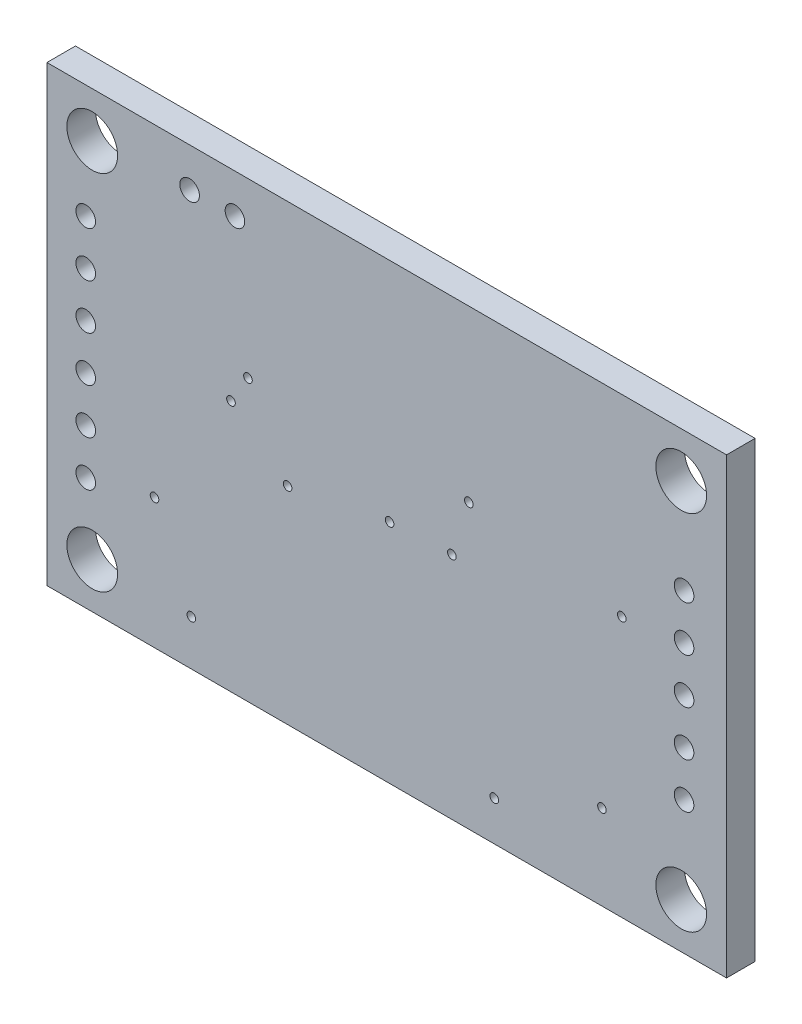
ISO-10303-21;
HEADER;
FILE_DESCRIPTION(('STEP AP214'),'2;1');
FILE_NAME('part.step','',(''),(''),'','','');
FILE_SCHEMA(('AUTOMOTIVE_DESIGN { 1 0 10303 214 1 1 1 1 }'));
ENDSEC;
DATA;
#1=APPLICATION_CONTEXT('core data for automotive mechanical design processes');
#2=APPLICATION_PROTOCOL_DEFINITION('international standard','automotive_design',2000,#1);
#3=PRODUCT_CONTEXT('',#1,'mechanical');
#4=PRODUCT('Part','Part','',(#3));
#5=PRODUCT_RELATED_PRODUCT_CATEGORY('part','',(#4));
#6=PRODUCT_DEFINITION_FORMATION('','',#4);
#7=PRODUCT_DEFINITION_CONTEXT('part definition',#1,'design');
#8=PRODUCT_DEFINITION('design','',#6,#7);
#9=PRODUCT_DEFINITION_SHAPE('','',#8);
#10=(LENGTH_UNIT() NAMED_UNIT(*) SI_UNIT(.MILLI.,.METRE.));
#11=(NAMED_UNIT(*) PLANE_ANGLE_UNIT() SI_UNIT($,.RADIAN.));
#12=(NAMED_UNIT(*) SI_UNIT($,.STERADIAN.) SOLID_ANGLE_UNIT());
#13=UNCERTAINTY_MEASURE_WITH_UNIT(LENGTH_MEASURE(1.E-05),#10,'distance_accuracy_value','');
#14=(GEOMETRIC_REPRESENTATION_CONTEXT(3) GLOBAL_UNCERTAINTY_ASSIGNED_CONTEXT((#13)) GLOBAL_UNIT_ASSIGNED_CONTEXT((#10,
#11,#12)) REPRESENTATION_CONTEXT('',''));
#15=CARTESIAN_POINT('',(0.,0.,0.));
#16=DIRECTION('',(0.,0.,1.));
#17=DIRECTION('',(1.,0.,0.));
#18=AXIS2_PLACEMENT_3D('',#15,#16,#17);
#19=CARTESIAN_POINT('',(-19.05,12.7,0.));
#20=DIRECTION('',(0.,0.,-1.));
#21=DIRECTION('',(-1.,0.,0.));
#22=AXIS2_PLACEMENT_3D('',#19,#20,#21);
#23=PLANE('',#22);
#24=CARTESIAN_POINT('',(-13.0175,-5.3975,0.));
#25=DIRECTION('',(0.,0.,1.));
#26=DIRECTION('',(1.,0.,0.));
#27=AXIS2_PLACEMENT_3D('',#24,#25,#26);
#28=CIRCLE('',#27,0.2413);
#29=CARTESIAN_POINT('',(-12.7762,-5.3975,0.));
#30=VERTEX_POINT('',#29);
#31=EDGE_CURVE('E162',#30,#30,#28,.F.);
#32=ORIENTED_EDGE('',*,*,#31,.T.);
#33=EDGE_LOOP('',(#32));
#34=FACE_BOUND('',#33,.T.);
#35=CARTESIAN_POINT('',(-5.556233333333,-1.113966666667,0.));
#36=DIRECTION('',(0.,0.,1.));
#37=DIRECTION('',(1.,0.,0.));
#38=AXIS2_PLACEMENT_3D('',#35,#36,#37);
#39=CIRCLE('',#38,0.2413);
#40=CARTESIAN_POINT('',(-5.314933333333,-1.113966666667,0.));
#41=VERTEX_POINT('',#40);
#42=EDGE_CURVE('E166',#41,#41,#39,.F.);
#43=ORIENTED_EDGE('',*,*,#42,.T.);
#44=EDGE_LOOP('',(#43));
#45=FACE_BOUND('',#44,.T.);
#46=CARTESIAN_POINT('',(0.158766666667,0.,0.));
#47=DIRECTION('',(0.,0.,1.));
#48=DIRECTION('',(1.,0.,0.));
#49=AXIS2_PLACEMENT_3D('',#46,#47,#48);
#50=CIRCLE('',#49,0.2413);
#51=CARTESIAN_POINT('',(0.400066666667,0.,0.));
#52=VERTEX_POINT('',#51);
#53=EDGE_CURVE('E169',#52,#52,#50,.F.);
#54=ORIENTED_EDGE('',*,*,#53,.T.);
#55=EDGE_LOOP('',(#54));
#56=FACE_BOUND('',#55,.T.);
#57=CARTESIAN_POINT('',(-8.731233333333,1.428733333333,0.));
#58=DIRECTION('',(0.,0.,1.));
#59=DIRECTION('',(1.,0.,0.));
#60=AXIS2_PLACEMENT_3D('',#57,#58,#59);
#61=CIRCLE('',#60,0.2413);
#62=CARTESIAN_POINT('',(-8.489933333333,1.428733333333,0.));
#63=VERTEX_POINT('',#62);
#64=EDGE_CURVE('E172',#63,#63,#61,.F.);
#65=ORIENTED_EDGE('',*,*,#64,.T.);
#66=EDGE_LOOP('',(#65));
#67=FACE_BOUND('',#66,.T.);
#68=CARTESIAN_POINT('',(6.0325,-10.4775,0.));
#69=DIRECTION('',(0.,0.,1.));
#70=DIRECTION('',(1.,0.,0.));
#71=AXIS2_PLACEMENT_3D('',#68,#69,#70);
#72=CIRCLE('',#71,0.2413);
#73=CARTESIAN_POINT('',(6.2738,-10.4775,0.));
#74=VERTEX_POINT('',#73);
#75=EDGE_CURVE('E175',#74,#74,#72,.F.);
#76=ORIENTED_EDGE('',*,*,#75,.T.);
#77=EDGE_LOOP('',(#76));
#78=FACE_BOUND('',#77,.T.);
#79=CARTESIAN_POINT('',(-10.95373333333,-10.16,0.));
#80=DIRECTION('',(0.,0.,1.));
#81=DIRECTION('',(1.,0.,0.));
#82=AXIS2_PLACEMENT_3D('',#79,#80,#81);
#83=CIRCLE('',#82,0.2413);
#84=CARTESIAN_POINT('',(-10.71243333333,-10.16,0.));
#85=VERTEX_POINT('',#84);
#86=EDGE_CURVE('E178',#85,#85,#83,.F.);
#87=ORIENTED_EDGE('',*,*,#86,.T.);
#88=EDGE_LOOP('',(#87));
#89=FACE_BOUND('',#88,.T.);
#90=CARTESIAN_POINT('',(12.065,-7.9375,0.));
#91=DIRECTION('',(0.,0.,1.));
#92=DIRECTION('',(1.,0.,0.));
#93=AXIS2_PLACEMENT_3D('',#90,#91,#92);
#94=CIRCLE('',#93,0.2413);
#95=CARTESIAN_POINT('',(12.3063,-7.9375,0.));
#96=VERTEX_POINT('',#95);
#97=EDGE_CURVE('E181',#96,#96,#94,.F.);
#98=ORIENTED_EDGE('',*,*,#97,.T.);
#99=EDGE_LOOP('',(#98));
#100=FACE_BOUND('',#99,.T.);
#101=CARTESIAN_POINT('',(3.651266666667,0.158733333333,0.));
#102=DIRECTION('',(0.,0.,1.));
#103=DIRECTION('',(1.,0.,0.));
#104=AXIS2_PLACEMENT_3D('',#101,#102,#103);
#105=CIRCLE('',#104,0.2413);
#106=CARTESIAN_POINT('',(3.892566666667,0.158733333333,0.));
#107=VERTEX_POINT('',#106);
#108=EDGE_CURVE('E184',#107,#107,#105,.F.);
#109=ORIENTED_EDGE('',*,*,#108,.T.);
#110=EDGE_LOOP('',(#109));
#111=FACE_BOUND('',#110,.T.);
#112=CARTESIAN_POINT('',(13.176266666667,1.905,0.));
#113=DIRECTION('',(0.,0.,1.));
#114=DIRECTION('',(1.,0.,0.));
#115=AXIS2_PLACEMENT_3D('',#112,#113,#114);
#116=CIRCLE('',#115,0.2413);
#117=CARTESIAN_POINT('',(13.417566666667,1.905,0.));
#118=VERTEX_POINT('',#117);
#119=EDGE_CURVE('E187',#118,#118,#116,.F.);
#120=ORIENTED_EDGE('',*,*,#119,.T.);
#121=EDGE_LOOP('',(#120));
#122=FACE_BOUND('',#121,.T.);
#123=CARTESIAN_POINT('',(-7.778733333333,3.016266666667,0.));
#124=DIRECTION('',(0.,0.,1.));
#125=DIRECTION('',(1.,0.,0.));
#126=AXIS2_PLACEMENT_3D('',#123,#124,#125);
#127=CIRCLE('',#126,0.2413);
#128=CARTESIAN_POINT('',(-7.537433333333,3.016266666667,0.));
#129=VERTEX_POINT('',#128);
#130=EDGE_CURVE('E190',#129,#129,#127,.F.);
#131=ORIENTED_EDGE('',*,*,#130,.T.);
#132=EDGE_LOOP('',(#131));
#133=FACE_BOUND('',#132,.T.);
#134=CARTESIAN_POINT('',(4.603766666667,3.175,0.));
#135=DIRECTION('',(0.,0.,1.));
#136=DIRECTION('',(1.,0.,0.));
#137=AXIS2_PLACEMENT_3D('',#134,#135,#136);
#138=CIRCLE('',#137,0.2413);
#139=CARTESIAN_POINT('',(4.845066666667,3.175,0.));
#140=VERTEX_POINT('',#139);
#141=EDGE_CURVE('E193',#140,#140,#138,.F.);
#142=ORIENTED_EDGE('',*,*,#141,.T.);
#143=EDGE_LOOP('',(#142));
#144=FACE_BOUND('',#143,.T.);
#145=CARTESIAN_POINT('',(16.668766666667,4.921266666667,0.));
#146=DIRECTION('',(0.,0.,1.));
#147=DIRECTION('',(1.,0.,0.));
#148=AXIS2_PLACEMENT_3D('',#145,#146,#147);
#149=CIRCLE('',#148,0.55);
#150=CARTESIAN_POINT('',(17.218766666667,4.921266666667,0.));
#151=VERTEX_POINT('',#150);
#152=EDGE_CURVE('E196',#151,#151,#149,.F.);
#153=ORIENTED_EDGE('',*,*,#152,.T.);
#154=EDGE_LOOP('',(#153));
#155=FACE_BOUND('',#154,.T.);
#156=CARTESIAN_POINT('',(16.668766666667,2.381266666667,0.));
#157=DIRECTION('',(0.,0.,1.));
#158=DIRECTION('',(1.,0.,0.));
#159=AXIS2_PLACEMENT_3D('',#156,#157,#158);
#160=CIRCLE('',#159,0.55);
#161=CARTESIAN_POINT('',(17.218766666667,2.381266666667,0.));
#162=VERTEX_POINT('',#161);
#163=EDGE_CURVE('E199',#162,#162,#160,.F.);
#164=ORIENTED_EDGE('',*,*,#163,.T.);
#165=EDGE_LOOP('',(#164));
#166=FACE_BOUND('',#165,.T.);
#167=CARTESIAN_POINT('',(16.668766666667,-0.158733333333,0.));
#168=DIRECTION('',(0.,0.,1.));
#169=DIRECTION('',(1.,0.,0.));
#170=AXIS2_PLACEMENT_3D('',#167,#168,#169);
#171=CIRCLE('',#170,0.55);
#172=CARTESIAN_POINT('',(17.218766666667,-0.158733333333,0.));
#173=VERTEX_POINT('',#172);
#174=EDGE_CURVE('E202',#173,#173,#171,.F.);
#175=ORIENTED_EDGE('',*,*,#174,.T.);
#176=EDGE_LOOP('',(#175));
#177=FACE_BOUND('',#176,.T.);
#178=CARTESIAN_POINT('',(16.668766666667,-2.698733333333,0.));
#179=DIRECTION('',(0.,0.,1.));
#180=DIRECTION('',(1.,0.,0.));
#181=AXIS2_PLACEMENT_3D('',#178,#179,#180);
#182=CIRCLE('',#181,0.55);
#183=CARTESIAN_POINT('',(17.218766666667,-2.698733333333,0.));
#184=VERTEX_POINT('',#183);
#185=EDGE_CURVE('E205',#184,#184,#182,.F.);
#186=ORIENTED_EDGE('',*,*,#185,.T.);
#187=EDGE_LOOP('',(#186));
#188=FACE_BOUND('',#187,.T.);
#189=CARTESIAN_POINT('',(16.668766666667,-5.238733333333,0.));
#190=DIRECTION('',(0.,0.,1.));
#191=DIRECTION('',(1.,0.,0.));
#192=AXIS2_PLACEMENT_3D('',#189,#190,#191);
#193=CIRCLE('',#192,0.55);
#194=CARTESIAN_POINT('',(17.218766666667,-5.238733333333,0.));
#195=VERTEX_POINT('',#194);
#196=EDGE_CURVE('E208',#195,#195,#193,.F.);
#197=ORIENTED_EDGE('',*,*,#196,.T.);
#198=EDGE_LOOP('',(#197));
#199=FACE_BOUND('',#198,.T.);
#200=CARTESIAN_POINT('',(-16.8752,6.3293,0.));
#201=DIRECTION('',(0.,0.,1.));
#202=DIRECTION('',(1.,0.,0.));
#203=AXIS2_PLACEMENT_3D('',#200,#201,#202);
#204=CIRCLE('',#203,0.55);
#205=CARTESIAN_POINT('',(-16.3252,6.3293,0.));
#206=VERTEX_POINT('',#205);
#207=EDGE_CURVE('E211',#206,#206,#204,.F.);
#208=ORIENTED_EDGE('',*,*,#207,.T.);
#209=EDGE_LOOP('',(#208));
#210=FACE_BOUND('',#209,.T.);
#211=CARTESIAN_POINT('',(-16.8752,3.7893,0.));
#212=DIRECTION('',(0.,0.,1.));
#213=DIRECTION('',(1.,0.,0.));
#214=AXIS2_PLACEMENT_3D('',#211,#212,#213);
#215=CIRCLE('',#214,0.55);
#216=CARTESIAN_POINT('',(-16.3252,3.7893,0.));
#217=VERTEX_POINT('',#216);
#218=EDGE_CURVE('E214',#217,#217,#215,.F.);
#219=ORIENTED_EDGE('',*,*,#218,.T.);
#220=EDGE_LOOP('',(#219));
#221=FACE_BOUND('',#220,.T.);
#222=CARTESIAN_POINT('',(-16.8752,1.2493,0.));
#223=DIRECTION('',(0.,0.,1.));
#224=DIRECTION('',(1.,0.,0.));
#225=AXIS2_PLACEMENT_3D('',#222,#223,#224);
#226=CIRCLE('',#225,0.55);
#227=CARTESIAN_POINT('',(-16.3252,1.2493,0.));
#228=VERTEX_POINT('',#227);
#229=EDGE_CURVE('E217',#228,#228,#226,.F.);
#230=ORIENTED_EDGE('',*,*,#229,.T.);
#231=EDGE_LOOP('',(#230));
#232=FACE_BOUND('',#231,.T.);
#233=CARTESIAN_POINT('',(-16.8752,-1.2907,0.));
#234=DIRECTION('',(0.,0.,1.));
#235=DIRECTION('',(1.,0.,0.));
#236=AXIS2_PLACEMENT_3D('',#233,#234,#235);
#237=CIRCLE('',#236,0.55);
#238=CARTESIAN_POINT('',(-16.3252,-1.2907,0.));
#239=VERTEX_POINT('',#238);
#240=EDGE_CURVE('E220',#239,#239,#237,.F.);
#241=ORIENTED_EDGE('',*,*,#240,.T.);
#242=EDGE_LOOP('',(#241));
#243=FACE_BOUND('',#242,.T.);
#244=CARTESIAN_POINT('',(-16.8752,-3.8307,0.));
#245=DIRECTION('',(0.,0.,1.));
#246=DIRECTION('',(1.,0.,0.));
#247=AXIS2_PLACEMENT_3D('',#244,#245,#246);
#248=CIRCLE('',#247,0.55);
#249=CARTESIAN_POINT('',(-16.3252,-3.8307,0.));
#250=VERTEX_POINT('',#249);
#251=EDGE_CURVE('E223',#250,#250,#248,.F.);
#252=ORIENTED_EDGE('',*,*,#251,.T.);
#253=EDGE_LOOP('',(#252));
#254=FACE_BOUND('',#253,.T.);
#255=CARTESIAN_POINT('',(-16.8752,-6.3707,0.));
#256=DIRECTION('',(0.,0.,1.));
#257=DIRECTION('',(1.,0.,0.));
#258=AXIS2_PLACEMENT_3D('',#255,#256,#257);
#259=CIRCLE('',#258,0.55);
#260=CARTESIAN_POINT('',(-16.3252,-6.3707,0.));
#261=VERTEX_POINT('',#260);
#262=EDGE_CURVE('E226',#261,#261,#259,.F.);
#263=ORIENTED_EDGE('',*,*,#262,.T.);
#264=EDGE_LOOP('',(#263));
#265=FACE_BOUND('',#264,.T.);
#266=CARTESIAN_POINT('',(-8.509966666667,10.510433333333,0.));
#267=DIRECTION('',(0.,0.,1.));
#268=DIRECTION('',(1.,0.,0.));
#269=AXIS2_PLACEMENT_3D('',#266,#267,#268);
#270=CIRCLE('',#269,0.55);
#271=CARTESIAN_POINT('',(-7.959966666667,10.510433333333,0.));
#272=VERTEX_POINT('',#271);
#273=EDGE_CURVE('E229',#272,#272,#270,.F.);
#274=ORIENTED_EDGE('',*,*,#273,.T.);
#275=EDGE_LOOP('',(#274));
#276=FACE_BOUND('',#275,.T.);
#277=CARTESIAN_POINT('',(-11.04996666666,10.510433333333,0.));
#278=DIRECTION('',(0.,0.,1.));
#279=DIRECTION('',(1.,0.,0.));
#280=AXIS2_PLACEMENT_3D('',#277,#278,#279);
#281=CIRCLE('',#280,0.55);
#282=CARTESIAN_POINT('',(-10.49996666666,10.510433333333,0.));
#283=VERTEX_POINT('',#282);
#284=EDGE_CURVE('E232',#283,#283,#281,.F.);
#285=ORIENTED_EDGE('',*,*,#284,.T.);
#286=EDGE_LOOP('',(#285));
#287=FACE_BOUND('',#286,.T.);
#288=CARTESIAN_POINT('',(16.51,-10.16,0.));
#289=DIRECTION('',(0.,0.,1.));
#290=DIRECTION('',(1.,0.,0.));
#291=AXIS2_PLACEMENT_3D('',#288,#289,#290);
#292=CIRCLE('',#291,1.4224);
#293=CARTESIAN_POINT('',(17.9324,-10.16,0.));
#294=VERTEX_POINT('',#293);
#295=EDGE_CURVE('E235',#294,#294,#292,.F.);
#296=ORIENTED_EDGE('',*,*,#295,.T.);
#297=EDGE_LOOP('',(#296));
#298=FACE_BOUND('',#297,.T.);
#299=CARTESIAN_POINT('',(-16.51,-10.16,0.));
#300=DIRECTION('',(0.,0.,1.));
#301=DIRECTION('',(1.,0.,0.));
#302=AXIS2_PLACEMENT_3D('',#299,#300,#301);
#303=CIRCLE('',#302,1.4224);
#304=CARTESIAN_POINT('',(-15.0876,-10.16,0.));
#305=VERTEX_POINT('',#304);
#306=EDGE_CURVE('E238',#305,#305,#303,.F.);
#307=ORIENTED_EDGE('',*,*,#306,.T.);
#308=EDGE_LOOP('',(#307));
#309=FACE_BOUND('',#308,.T.);
#310=CARTESIAN_POINT('',(16.51,10.16,0.));
#311=DIRECTION('',(0.,0.,1.));
#312=DIRECTION('',(1.,0.,0.));
#313=AXIS2_PLACEMENT_3D('',#310,#311,#312);
#314=CIRCLE('',#313,1.4224);
#315=CARTESIAN_POINT('',(17.9324,10.16,0.));
#316=VERTEX_POINT('',#315);
#317=EDGE_CURVE('E240',#316,#316,#314,.F.);
#318=ORIENTED_EDGE('',*,*,#317,.T.);
#319=EDGE_LOOP('',(#318));
#320=FACE_BOUND('',#319,.T.);
#321=CARTESIAN_POINT('',(-16.51,10.16,0.));
#322=DIRECTION('',(0.,0.,1.));
#323=DIRECTION('',(1.,0.,0.));
#324=AXIS2_PLACEMENT_3D('',#321,#322,#323);
#325=CIRCLE('',#324,1.4224);
#326=CARTESIAN_POINT('',(-15.0876,10.16,0.));
#327=VERTEX_POINT('',#326);
#328=EDGE_CURVE('E20',#327,#327,#325,.F.);
#329=ORIENTED_EDGE('',*,*,#328,.T.);
#330=EDGE_LOOP('',(#329));
#331=FACE_BOUND('',#330,.T.);
#332=DIRECTION('',(1.,0.,0.));
#333=VECTOR('',#332,1.);
#334=CARTESIAN_POINT('',(-19.05,-12.7,0.));
#335=LINE('',#334,#333);
#336=CARTESIAN_POINT('',(19.05,-12.7,0.));
#337=VERTEX_POINT('',#336);
#338=CARTESIAN_POINT('',(-19.05,-12.7,0.));
#339=VERTEX_POINT('',#338);
#340=EDGE_CURVE('E70',#337,#339,#335,.F.);
#341=ORIENTED_EDGE('',*,*,#340,.F.);
#342=DIRECTION('',(0.,1.,0.));
#343=VECTOR('',#342,1.);
#344=CARTESIAN_POINT('',(19.05,-12.7,0.));
#345=LINE('',#344,#343);
#346=CARTESIAN_POINT('',(19.05,12.7,0.));
#347=VERTEX_POINT('',#346);
#348=EDGE_CURVE('E55',#347,#337,#345,.F.);
#349=ORIENTED_EDGE('',*,*,#348,.F.);
#350=DIRECTION('',(1.,0.,0.));
#351=VECTOR('',#350,1.);
#352=CARTESIAN_POINT('',(19.05,12.7,0.));
#353=LINE('',#352,#351);
#354=CARTESIAN_POINT('',(-19.05,12.7,0.));
#355=VERTEX_POINT('',#354);
#356=EDGE_CURVE('E60',#355,#347,#353,.T.);
#357=ORIENTED_EDGE('',*,*,#356,.F.);
#358=DIRECTION('',(0.,1.,0.));
#359=VECTOR('',#358,1.);
#360=CARTESIAN_POINT('',(-19.05,12.7,0.));
#361=LINE('',#360,#359);
#362=EDGE_CURVE('E245',#339,#355,#361,.T.);
#363=ORIENTED_EDGE('',*,*,#362,.F.);
#364=EDGE_LOOP('',(#341,#349,#357,#363));
#365=FACE_BOUND('',#364,.T.);
#366=ADVANCED_FACE('F17',(#34,#45,#56,#67,#78,#89,#100,#111,#122,#133,#144,#155,#166,#177,#188,
#199,#210,#221,#232,#243,#254,#265,#276,#287,#298,#309,#320,#331,#365),#23,.F.);
#367=CARTESIAN_POINT('',(19.05,12.7,0.));
#368=DIRECTION('',(0.,1.,0.));
#369=DIRECTION('',(0.,0.,1.));
#370=AXIS2_PLACEMENT_3D('',#367,#368,#369);
#371=PLANE('',#370);
#372=DIRECTION('',(0.,0.,1.));
#373=VECTOR('',#372,1.);
#374=CARTESIAN_POINT('',(-19.05,12.7,0.));
#375=LINE('',#374,#373);
#376=CARTESIAN_POINT('',(-19.05,12.7,-1.6002));
#377=VERTEX_POINT('',#376);
#378=EDGE_CURVE('E65',#355,#377,#375,.F.);
#379=ORIENTED_EDGE('',*,*,#378,.F.);
#380=ORIENTED_EDGE('',*,*,#356,.T.);
#381=DIRECTION('',(0.,0.,-1.));
#382=VECTOR('',#381,1.);
#383=CARTESIAN_POINT('',(19.05,12.7,0.));
#384=LINE('',#383,#382);
#385=CARTESIAN_POINT('',(19.05,12.7,-1.6002));
#386=VERTEX_POINT('',#385);
#387=EDGE_CURVE('E62',#386,#347,#384,.F.);
#388=ORIENTED_EDGE('',*,*,#387,.F.);
#389=DIRECTION('',(-1.,0.,0.));
#390=VECTOR('',#389,1.);
#391=CARTESIAN_POINT('',(-19.05,12.7,-1.6002));
#392=LINE('',#391,#390);
#393=EDGE_CURVE('E165',#377,#386,#392,.F.);
#394=ORIENTED_EDGE('',*,*,#393,.F.);
#395=EDGE_LOOP('',(#379,#380,#388,#394));
#396=FACE_BOUND('',#395,.T.);
#397=ADVANCED_FACE('F61',(#396),#371,.T.);
#398=CARTESIAN_POINT('',(19.05,-12.7,0.));
#399=DIRECTION('',(1.,0.,0.));
#400=DIRECTION('',(0.,0.,-1.));
#401=AXIS2_PLACEMENT_3D('',#398,#399,#400);
#402=PLANE('',#401);
#403=ORIENTED_EDGE('',*,*,#387,.T.);
#404=ORIENTED_EDGE('',*,*,#348,.T.);
#405=DIRECTION('',(0.,0.,-1.));
#406=VECTOR('',#405,1.);
#407=CARTESIAN_POINT('',(19.05,-12.7,0.));
#408=LINE('',#407,#406);
#409=CARTESIAN_POINT('',(19.05,-12.7,-1.6002));
#410=VERTEX_POINT('',#409);
#411=EDGE_CURVE('E72',#410,#337,#408,.F.);
#412=ORIENTED_EDGE('',*,*,#411,.F.);
#413=DIRECTION('',(0.,1.,0.));
#414=VECTOR('',#413,1.);
#415=CARTESIAN_POINT('',(19.05,12.7,-1.6002));
#416=LINE('',#415,#414);
#417=EDGE_CURVE('E76',#386,#410,#416,.F.);
#418=ORIENTED_EDGE('',*,*,#417,.F.);
#419=EDGE_LOOP('',(#403,#404,#412,#418));
#420=FACE_BOUND('',#419,.T.);
#421=ADVANCED_FACE('F74',(#420),#402,.T.);
#422=CARTESIAN_POINT('',(-19.05,-12.7,0.));
#423=DIRECTION('',(0.,-1.,0.));
#424=DIRECTION('',(0.,0.,-1.));
#425=AXIS2_PLACEMENT_3D('',#422,#423,#424);
#426=PLANE('',#425);
#427=ORIENTED_EDGE('',*,*,#411,.T.);
#428=ORIENTED_EDGE('',*,*,#340,.T.);
#429=DIRECTION('',(0.,0.,1.));
#430=VECTOR('',#429,1.);
#431=CARTESIAN_POINT('',(-19.05,-12.7,0.));
#432=LINE('',#431,#430);
#433=CARTESIAN_POINT('',(-19.05,-12.7,-1.6002));
#434=VERTEX_POINT('',#433);
#435=EDGE_CURVE('E35',#434,#339,#432,.T.);
#436=ORIENTED_EDGE('',*,*,#435,.F.);
#437=DIRECTION('',(-1.,0.,0.));
#438=VECTOR('',#437,1.);
#439=CARTESIAN_POINT('',(-19.05,-12.7,-1.6002));
#440=LINE('',#439,#438);
#441=EDGE_CURVE('E257',#410,#434,#440,.T.);
#442=ORIENTED_EDGE('',*,*,#441,.F.);
#443=EDGE_LOOP('',(#427,#428,#436,#442));
#444=FACE_BOUND('',#443,.T.);
#445=ADVANCED_FACE('F255',(#444),#426,.T.);
#446=CARTESIAN_POINT('',(-19.05,12.7,0.));
#447=DIRECTION('',(-1.,0.,0.));
#448=DIRECTION('',(0.,0.,1.));
#449=AXIS2_PLACEMENT_3D('',#446,#447,#448);
#450=PLANE('',#449);
#451=ORIENTED_EDGE('',*,*,#435,.T.);
#452=ORIENTED_EDGE('',*,*,#362,.T.);
#453=ORIENTED_EDGE('',*,*,#378,.T.);
#454=DIRECTION('',(0.,1.,0.));
#455=VECTOR('',#454,1.);
#456=CARTESIAN_POINT('',(-19.05,12.7,-1.6002));
#457=LINE('',#456,#455);
#458=EDGE_CURVE('E161',#434,#377,#457,.T.);
#459=ORIENTED_EDGE('',*,*,#458,.F.);
#460=EDGE_LOOP('',(#451,#452,#453,#459));
#461=FACE_BOUND('',#460,.T.);
#462=ADVANCED_FACE('F263',(#461),#450,.T.);
#463=CARTESIAN_POINT('',(-16.51,10.16,0.));
#464=DIRECTION('',(0.,0.,1.));
#465=DIRECTION('',(1.,0.,0.));
#466=AXIS2_PLACEMENT_3D('',#463,#464,#465);
#467=CYLINDRICAL_SURFACE('',#466,1.4224);
#468=CARTESIAN_POINT('',(-16.51,10.16,-1.6002));
#469=DIRECTION('',(0.,0.,1.));
#470=DIRECTION('',(1.,0.,0.));
#471=AXIS2_PLACEMENT_3D('',#468,#469,#470);
#472=CIRCLE('',#471,1.4224);
#473=CARTESIAN_POINT('',(-15.0876,10.16,-1.6002));
#474=VERTEX_POINT('',#473);
#475=EDGE_CURVE('E158',#474,#474,#472,.T.);
#476=ORIENTED_EDGE('',*,*,#475,.F.);
#477=EDGE_LOOP('',(#476));
#478=FACE_BOUND('',#477,.T.);
#479=ORIENTED_EDGE('',*,*,#328,.F.);
#480=EDGE_LOOP('',(#479));
#481=FACE_BOUND('',#480,.T.);
#482=ADVANCED_FACE('F265',(#478,#481),#467,.F.);
#483=CARTESIAN_POINT('',(16.51,10.16,0.));
#484=DIRECTION('',(0.,0.,1.));
#485=DIRECTION('',(1.,0.,0.));
#486=AXIS2_PLACEMENT_3D('',#483,#484,#485);
#487=CYLINDRICAL_SURFACE('',#486,1.4224);
#488=CARTESIAN_POINT('',(16.51,10.16,-1.6002));
#489=DIRECTION('',(0.,0.,1.));
#490=DIRECTION('',(1.,0.,0.));
#491=AXIS2_PLACEMENT_3D('',#488,#489,#490);
#492=CIRCLE('',#491,1.4224);
#493=CARTESIAN_POINT('',(17.9324,10.16,-1.6002));
#494=VERTEX_POINT('',#493);
#495=EDGE_CURVE('E155',#494,#494,#492,.T.);
#496=ORIENTED_EDGE('',*,*,#495,.F.);
#497=EDGE_LOOP('',(#496));
#498=FACE_BOUND('',#497,.T.);
#499=ORIENTED_EDGE('',*,*,#317,.F.);
#500=EDGE_LOOP('',(#499));
#501=FACE_BOUND('',#500,.T.);
#502=ADVANCED_FACE('F272',(#498,#501),#487,.F.);
#503=CARTESIAN_POINT('',(-16.51,-10.16,0.));
#504=DIRECTION('',(0.,0.,1.));
#505=DIRECTION('',(1.,0.,0.));
#506=AXIS2_PLACEMENT_3D('',#503,#504,#505);
#507=CYLINDRICAL_SURFACE('',#506,1.4224);
#508=CARTESIAN_POINT('',(-16.51,-10.16,-1.6002));
#509=DIRECTION('',(0.,0.,1.));
#510=DIRECTION('',(1.,0.,0.));
#511=AXIS2_PLACEMENT_3D('',#508,#509,#510);
#512=CIRCLE('',#511,1.4224);
#513=CARTESIAN_POINT('',(-15.0876,-10.16,-1.6002));
#514=VERTEX_POINT('',#513);
#515=EDGE_CURVE('E152',#514,#514,#512,.T.);
#516=ORIENTED_EDGE('',*,*,#515,.F.);
#517=EDGE_LOOP('',(#516));
#518=FACE_BOUND('',#517,.T.);
#519=ORIENTED_EDGE('',*,*,#306,.F.);
#520=EDGE_LOOP('',(#519));
#521=FACE_BOUND('',#520,.T.);
#522=ADVANCED_FACE('F382',(#518,#521),#507,.F.);
#523=CARTESIAN_POINT('',(16.51,-10.16,0.));
#524=DIRECTION('',(0.,0.,1.));
#525=DIRECTION('',(1.,0.,0.));
#526=AXIS2_PLACEMENT_3D('',#523,#524,#525);
#527=CYLINDRICAL_SURFACE('',#526,1.4224);
#528=CARTESIAN_POINT('',(16.51,-10.16,-1.6002));
#529=DIRECTION('',(0.,0.,1.));
#530=DIRECTION('',(1.,0.,0.));
#531=AXIS2_PLACEMENT_3D('',#528,#529,#530);
#532=CIRCLE('',#531,1.4224);
#533=CARTESIAN_POINT('',(17.9324,-10.16,-1.6002));
#534=VERTEX_POINT('',#533);
#535=EDGE_CURVE('E149',#534,#534,#532,.T.);
#536=ORIENTED_EDGE('',*,*,#535,.F.);
#537=EDGE_LOOP('',(#536));
#538=FACE_BOUND('',#537,.T.);
#539=ORIENTED_EDGE('',*,*,#295,.F.);
#540=EDGE_LOOP('',(#539));
#541=FACE_BOUND('',#540,.T.);
#542=ADVANCED_FACE('F378',(#538,#541),#527,.F.);
#543=CARTESIAN_POINT('',(-11.04996666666,10.510433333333,0.));
#544=DIRECTION('',(0.,0.,1.));
#545=DIRECTION('',(1.,0.,0.));
#546=AXIS2_PLACEMENT_3D('',#543,#544,#545);
#547=CYLINDRICAL_SURFACE('',#546,0.55);
#548=CARTESIAN_POINT('',(-11.04996666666,10.510433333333,-1.6002));
#549=DIRECTION('',(0.,0.,1.));
#550=DIRECTION('',(1.,0.,0.));
#551=AXIS2_PLACEMENT_3D('',#548,#549,#550);
#552=CIRCLE('',#551,0.55);
#553=CARTESIAN_POINT('',(-10.49996666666,10.510433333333,-1.6002));
#554=VERTEX_POINT('',#553);
#555=EDGE_CURVE('E146',#554,#554,#552,.T.);
#556=ORIENTED_EDGE('',*,*,#555,.F.);
#557=EDGE_LOOP('',(#556));
#558=FACE_BOUND('',#557,.T.);
#559=ORIENTED_EDGE('',*,*,#284,.F.);
#560=EDGE_LOOP('',(#559));
#561=FACE_BOUND('',#560,.T.);
#562=ADVANCED_FACE('F374',(#558,#561),#547,.F.);
#563=CARTESIAN_POINT('',(-8.509966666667,10.510433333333,0.));
#564=DIRECTION('',(0.,0.,1.));
#565=DIRECTION('',(1.,0.,0.));
#566=AXIS2_PLACEMENT_3D('',#563,#564,#565);
#567=CYLINDRICAL_SURFACE('',#566,0.55);
#568=CARTESIAN_POINT('',(-8.509966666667,10.510433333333,-1.6002));
#569=DIRECTION('',(0.,0.,1.));
#570=DIRECTION('',(1.,0.,0.));
#571=AXIS2_PLACEMENT_3D('',#568,#569,#570);
#572=CIRCLE('',#571,0.55);
#573=CARTESIAN_POINT('',(-7.959966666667,10.510433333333,-1.6002));
#574=VERTEX_POINT('',#573);
#575=EDGE_CURVE('E143',#574,#574,#572,.T.);
#576=ORIENTED_EDGE('',*,*,#575,.F.);
#577=EDGE_LOOP('',(#576));
#578=FACE_BOUND('',#577,.T.);
#579=ORIENTED_EDGE('',*,*,#273,.F.);
#580=EDGE_LOOP('',(#579));
#581=FACE_BOUND('',#580,.T.);
#582=ADVANCED_FACE('F370',(#578,#581),#567,.F.);
#583=CARTESIAN_POINT('',(-16.8752,-6.3707,0.));
#584=DIRECTION('',(0.,0.,1.));
#585=DIRECTION('',(1.,0.,0.));
#586=AXIS2_PLACEMENT_3D('',#583,#584,#585);
#587=CYLINDRICAL_SURFACE('',#586,0.55);
#588=CARTESIAN_POINT('',(-16.8752,-6.3707,-1.6002));
#589=DIRECTION('',(0.,0.,1.));
#590=DIRECTION('',(1.,0.,0.));
#591=AXIS2_PLACEMENT_3D('',#588,#589,#590);
#592=CIRCLE('',#591,0.55);
#593=CARTESIAN_POINT('',(-16.3252,-6.3707,-1.6002));
#594=VERTEX_POINT('',#593);
#595=EDGE_CURVE('E140',#594,#594,#592,.T.);
#596=ORIENTED_EDGE('',*,*,#595,.F.);
#597=EDGE_LOOP('',(#596));
#598=FACE_BOUND('',#597,.T.);
#599=ORIENTED_EDGE('',*,*,#262,.F.);
#600=EDGE_LOOP('',(#599));
#601=FACE_BOUND('',#600,.T.);
#602=ADVANCED_FACE('F366',(#598,#601),#587,.F.);
#603=CARTESIAN_POINT('',(-16.8752,-3.8307,0.));
#604=DIRECTION('',(0.,0.,1.));
#605=DIRECTION('',(1.,0.,0.));
#606=AXIS2_PLACEMENT_3D('',#603,#604,#605);
#607=CYLINDRICAL_SURFACE('',#606,0.55);
#608=CARTESIAN_POINT('',(-16.8752,-3.8307,-1.6002));
#609=DIRECTION('',(0.,0.,1.));
#610=DIRECTION('',(1.,0.,0.));
#611=AXIS2_PLACEMENT_3D('',#608,#609,#610);
#612=CIRCLE('',#611,0.55);
#613=CARTESIAN_POINT('',(-16.3252,-3.8307,-1.6002));
#614=VERTEX_POINT('',#613);
#615=EDGE_CURVE('E137',#614,#614,#612,.T.);
#616=ORIENTED_EDGE('',*,*,#615,.F.);
#617=EDGE_LOOP('',(#616));
#618=FACE_BOUND('',#617,.T.);
#619=ORIENTED_EDGE('',*,*,#251,.F.);
#620=EDGE_LOOP('',(#619));
#621=FACE_BOUND('',#620,.T.);
#622=ADVANCED_FACE('F362',(#618,#621),#607,.F.);
#623=CARTESIAN_POINT('',(-16.8752,-1.2907,0.));
#624=DIRECTION('',(0.,0.,1.));
#625=DIRECTION('',(1.,0.,0.));
#626=AXIS2_PLACEMENT_3D('',#623,#624,#625);
#627=CYLINDRICAL_SURFACE('',#626,0.55);
#628=CARTESIAN_POINT('',(-16.8752,-1.2907,-1.6002));
#629=DIRECTION('',(0.,0.,1.));
#630=DIRECTION('',(1.,0.,0.));
#631=AXIS2_PLACEMENT_3D('',#628,#629,#630);
#632=CIRCLE('',#631,0.55);
#633=CARTESIAN_POINT('',(-16.3252,-1.2907,-1.6002));
#634=VERTEX_POINT('',#633);
#635=EDGE_CURVE('E134',#634,#634,#632,.T.);
#636=ORIENTED_EDGE('',*,*,#635,.F.);
#637=EDGE_LOOP('',(#636));
#638=FACE_BOUND('',#637,.T.);
#639=ORIENTED_EDGE('',*,*,#240,.F.);
#640=EDGE_LOOP('',(#639));
#641=FACE_BOUND('',#640,.T.);
#642=ADVANCED_FACE('F358',(#638,#641),#627,.F.);
#643=CARTESIAN_POINT('',(-16.8752,1.2493,0.));
#644=DIRECTION('',(0.,0.,1.));
#645=DIRECTION('',(1.,0.,0.));
#646=AXIS2_PLACEMENT_3D('',#643,#644,#645);
#647=CYLINDRICAL_SURFACE('',#646,0.55);
#648=CARTESIAN_POINT('',(-16.8752,1.2493,-1.6002));
#649=DIRECTION('',(0.,0.,1.));
#650=DIRECTION('',(1.,0.,0.));
#651=AXIS2_PLACEMENT_3D('',#648,#649,#650);
#652=CIRCLE('',#651,0.55);
#653=CARTESIAN_POINT('',(-16.3252,1.2493,-1.6002));
#654=VERTEX_POINT('',#653);
#655=EDGE_CURVE('E131',#654,#654,#652,.T.);
#656=ORIENTED_EDGE('',*,*,#655,.F.);
#657=EDGE_LOOP('',(#656));
#658=FACE_BOUND('',#657,.T.);
#659=ORIENTED_EDGE('',*,*,#229,.F.);
#660=EDGE_LOOP('',(#659));
#661=FACE_BOUND('',#660,.T.);
#662=ADVANCED_FACE('F354',(#658,#661),#647,.F.);
#663=CARTESIAN_POINT('',(-16.8752,3.7893,0.));
#664=DIRECTION('',(0.,0.,1.));
#665=DIRECTION('',(1.,0.,0.));
#666=AXIS2_PLACEMENT_3D('',#663,#664,#665);
#667=CYLINDRICAL_SURFACE('',#666,0.55);
#668=CARTESIAN_POINT('',(-16.8752,3.7893,-1.6002));
#669=DIRECTION('',(0.,0.,1.));
#670=DIRECTION('',(1.,0.,0.));
#671=AXIS2_PLACEMENT_3D('',#668,#669,#670);
#672=CIRCLE('',#671,0.55);
#673=CARTESIAN_POINT('',(-16.3252,3.7893,-1.6002));
#674=VERTEX_POINT('',#673);
#675=EDGE_CURVE('E128',#674,#674,#672,.T.);
#676=ORIENTED_EDGE('',*,*,#675,.F.);
#677=EDGE_LOOP('',(#676));
#678=FACE_BOUND('',#677,.T.);
#679=ORIENTED_EDGE('',*,*,#218,.F.);
#680=EDGE_LOOP('',(#679));
#681=FACE_BOUND('',#680,.T.);
#682=ADVANCED_FACE('F350',(#678,#681),#667,.F.);
#683=CARTESIAN_POINT('',(-16.8752,6.3293,0.));
#684=DIRECTION('',(0.,0.,1.));
#685=DIRECTION('',(1.,0.,0.));
#686=AXIS2_PLACEMENT_3D('',#683,#684,#685);
#687=CYLINDRICAL_SURFACE('',#686,0.55);
#688=CARTESIAN_POINT('',(-16.8752,6.3293,-1.6002));
#689=DIRECTION('',(0.,0.,1.));
#690=DIRECTION('',(1.,0.,0.));
#691=AXIS2_PLACEMENT_3D('',#688,#689,#690);
#692=CIRCLE('',#691,0.55);
#693=CARTESIAN_POINT('',(-16.3252,6.3293,-1.6002));
#694=VERTEX_POINT('',#693);
#695=EDGE_CURVE('E125',#694,#694,#692,.T.);
#696=ORIENTED_EDGE('',*,*,#695,.F.);
#697=EDGE_LOOP('',(#696));
#698=FACE_BOUND('',#697,.T.);
#699=ORIENTED_EDGE('',*,*,#207,.F.);
#700=EDGE_LOOP('',(#699));
#701=FACE_BOUND('',#700,.T.);
#702=ADVANCED_FACE('F346',(#698,#701),#687,.F.);
#703=CARTESIAN_POINT('',(16.668766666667,-5.238733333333,0.));
#704=DIRECTION('',(0.,0.,1.));
#705=DIRECTION('',(1.,0.,0.));
#706=AXIS2_PLACEMENT_3D('',#703,#704,#705);
#707=CYLINDRICAL_SURFACE('',#706,0.55);
#708=CARTESIAN_POINT('',(16.668766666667,-5.238733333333,-1.6002));
#709=DIRECTION('',(0.,0.,1.));
#710=DIRECTION('',(1.,0.,0.));
#711=AXIS2_PLACEMENT_3D('',#708,#709,#710);
#712=CIRCLE('',#711,0.55);
#713=CARTESIAN_POINT('',(17.218766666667,-5.238733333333,-1.6002));
#714=VERTEX_POINT('',#713);
#715=EDGE_CURVE('E122',#714,#714,#712,.T.);
#716=ORIENTED_EDGE('',*,*,#715,.F.);
#717=EDGE_LOOP('',(#716));
#718=FACE_BOUND('',#717,.T.);
#719=ORIENTED_EDGE('',*,*,#196,.F.);
#720=EDGE_LOOP('',(#719));
#721=FACE_BOUND('',#720,.T.);
#722=ADVANCED_FACE('F342',(#718,#721),#707,.F.);
#723=CARTESIAN_POINT('',(16.668766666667,-2.698733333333,0.));
#724=DIRECTION('',(0.,0.,1.));
#725=DIRECTION('',(1.,0.,0.));
#726=AXIS2_PLACEMENT_3D('',#723,#724,#725);
#727=CYLINDRICAL_SURFACE('',#726,0.55);
#728=CARTESIAN_POINT('',(16.668766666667,-2.698733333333,-1.6002));
#729=DIRECTION('',(0.,0.,1.));
#730=DIRECTION('',(1.,0.,0.));
#731=AXIS2_PLACEMENT_3D('',#728,#729,#730);
#732=CIRCLE('',#731,0.55);
#733=CARTESIAN_POINT('',(17.218766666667,-2.698733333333,-1.6002));
#734=VERTEX_POINT('',#733);
#735=EDGE_CURVE('E119',#734,#734,#732,.T.);
#736=ORIENTED_EDGE('',*,*,#735,.F.);
#737=EDGE_LOOP('',(#736));
#738=FACE_BOUND('',#737,.T.);
#739=ORIENTED_EDGE('',*,*,#185,.F.);
#740=EDGE_LOOP('',(#739));
#741=FACE_BOUND('',#740,.T.);
#742=ADVANCED_FACE('F338',(#738,#741),#727,.F.);
#743=CARTESIAN_POINT('',(16.668766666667,-0.158733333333,0.));
#744=DIRECTION('',(0.,0.,1.));
#745=DIRECTION('',(1.,0.,0.));
#746=AXIS2_PLACEMENT_3D('',#743,#744,#745);
#747=CYLINDRICAL_SURFACE('',#746,0.55);
#748=CARTESIAN_POINT('',(16.668766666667,-0.158733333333,-1.6002));
#749=DIRECTION('',(0.,0.,1.));
#750=DIRECTION('',(1.,0.,0.));
#751=AXIS2_PLACEMENT_3D('',#748,#749,#750);
#752=CIRCLE('',#751,0.55);
#753=CARTESIAN_POINT('',(17.218766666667,-0.158733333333,-1.6002));
#754=VERTEX_POINT('',#753);
#755=EDGE_CURVE('E116',#754,#754,#752,.T.);
#756=ORIENTED_EDGE('',*,*,#755,.F.);
#757=EDGE_LOOP('',(#756));
#758=FACE_BOUND('',#757,.T.);
#759=ORIENTED_EDGE('',*,*,#174,.F.);
#760=EDGE_LOOP('',(#759));
#761=FACE_BOUND('',#760,.T.);
#762=ADVANCED_FACE('F334',(#758,#761),#747,.F.);
#763=CARTESIAN_POINT('',(16.668766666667,2.381266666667,0.));
#764=DIRECTION('',(0.,0.,1.));
#765=DIRECTION('',(1.,0.,0.));
#766=AXIS2_PLACEMENT_3D('',#763,#764,#765);
#767=CYLINDRICAL_SURFACE('',#766,0.55);
#768=CARTESIAN_POINT('',(16.668766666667,2.381266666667,-1.6002));
#769=DIRECTION('',(0.,0.,1.));
#770=DIRECTION('',(1.,0.,0.));
#771=AXIS2_PLACEMENT_3D('',#768,#769,#770);
#772=CIRCLE('',#771,0.55);
#773=CARTESIAN_POINT('',(17.218766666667,2.381266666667,-1.6002));
#774=VERTEX_POINT('',#773);
#775=EDGE_CURVE('E113',#774,#774,#772,.T.);
#776=ORIENTED_EDGE('',*,*,#775,.F.);
#777=EDGE_LOOP('',(#776));
#778=FACE_BOUND('',#777,.T.);
#779=ORIENTED_EDGE('',*,*,#163,.F.);
#780=EDGE_LOOP('',(#779));
#781=FACE_BOUND('',#780,.T.);
#782=ADVANCED_FACE('F330',(#778,#781),#767,.F.);
#783=CARTESIAN_POINT('',(16.668766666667,4.921266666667,0.));
#784=DIRECTION('',(0.,0.,1.));
#785=DIRECTION('',(1.,0.,0.));
#786=AXIS2_PLACEMENT_3D('',#783,#784,#785);
#787=CYLINDRICAL_SURFACE('',#786,0.55);
#788=CARTESIAN_POINT('',(16.668766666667,4.921266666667,-1.6002));
#789=DIRECTION('',(0.,0.,1.));
#790=DIRECTION('',(1.,0.,0.));
#791=AXIS2_PLACEMENT_3D('',#788,#789,#790);
#792=CIRCLE('',#791,0.55);
#793=CARTESIAN_POINT('',(17.218766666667,4.921266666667,-1.6002));
#794=VERTEX_POINT('',#793);
#795=EDGE_CURVE('E110',#794,#794,#792,.T.);
#796=ORIENTED_EDGE('',*,*,#795,.F.);
#797=EDGE_LOOP('',(#796));
#798=FACE_BOUND('',#797,.T.);
#799=ORIENTED_EDGE('',*,*,#152,.F.);
#800=EDGE_LOOP('',(#799));
#801=FACE_BOUND('',#800,.T.);
#802=ADVANCED_FACE('F326',(#798,#801),#787,.F.);
#803=CARTESIAN_POINT('',(4.603766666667,3.175,0.));
#804=DIRECTION('',(0.,0.,1.));
#805=DIRECTION('',(1.,0.,0.));
#806=AXIS2_PLACEMENT_3D('',#803,#804,#805);
#807=CYLINDRICAL_SURFACE('',#806,0.2413);
#808=CARTESIAN_POINT('',(4.603766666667,3.175,-1.6002));
#809=DIRECTION('',(0.,0.,1.));
#810=DIRECTION('',(1.,0.,0.));
#811=AXIS2_PLACEMENT_3D('',#808,#809,#810);
#812=CIRCLE('',#811,0.2413);
#813=CARTESIAN_POINT('',(4.845066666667,3.175,-1.6002));
#814=VERTEX_POINT('',#813);
#815=EDGE_CURVE('E107',#814,#814,#812,.T.);
#816=ORIENTED_EDGE('',*,*,#815,.F.);
#817=EDGE_LOOP('',(#816));
#818=FACE_BOUND('',#817,.T.);
#819=ORIENTED_EDGE('',*,*,#141,.F.);
#820=EDGE_LOOP('',(#819));
#821=FACE_BOUND('',#820,.T.);
#822=ADVANCED_FACE('F322',(#818,#821),#807,.F.);
#823=CARTESIAN_POINT('',(-7.778733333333,3.016266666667,0.));
#824=DIRECTION('',(0.,0.,1.));
#825=DIRECTION('',(1.,0.,0.));
#826=AXIS2_PLACEMENT_3D('',#823,#824,#825);
#827=CYLINDRICAL_SURFACE('',#826,0.2413);
#828=CARTESIAN_POINT('',(-7.778733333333,3.016266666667,-1.6002));
#829=DIRECTION('',(0.,0.,1.));
#830=DIRECTION('',(1.,0.,0.));
#831=AXIS2_PLACEMENT_3D('',#828,#829,#830);
#832=CIRCLE('',#831,0.2413);
#833=CARTESIAN_POINT('',(-7.537433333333,3.016266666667,-1.6002));
#834=VERTEX_POINT('',#833);
#835=EDGE_CURVE('E104',#834,#834,#832,.T.);
#836=ORIENTED_EDGE('',*,*,#835,.F.);
#837=EDGE_LOOP('',(#836));
#838=FACE_BOUND('',#837,.T.);
#839=ORIENTED_EDGE('',*,*,#130,.F.);
#840=EDGE_LOOP('',(#839));
#841=FACE_BOUND('',#840,.T.);
#842=ADVANCED_FACE('F318',(#838,#841),#827,.F.);
#843=CARTESIAN_POINT('',(13.176266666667,1.905,0.));
#844=DIRECTION('',(0.,0.,1.));
#845=DIRECTION('',(1.,0.,0.));
#846=AXIS2_PLACEMENT_3D('',#843,#844,#845);
#847=CYLINDRICAL_SURFACE('',#846,0.2413);
#848=CARTESIAN_POINT('',(13.176266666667,1.905,-1.6002));
#849=DIRECTION('',(0.,0.,1.));
#850=DIRECTION('',(1.,0.,0.));
#851=AXIS2_PLACEMENT_3D('',#848,#849,#850);
#852=CIRCLE('',#851,0.2413);
#853=CARTESIAN_POINT('',(13.417566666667,1.905,-1.6002));
#854=VERTEX_POINT('',#853);
#855=EDGE_CURVE('E101',#854,#854,#852,.T.);
#856=ORIENTED_EDGE('',*,*,#855,.F.);
#857=EDGE_LOOP('',(#856));
#858=FACE_BOUND('',#857,.T.);
#859=ORIENTED_EDGE('',*,*,#119,.F.);
#860=EDGE_LOOP('',(#859));
#861=FACE_BOUND('',#860,.T.);
#862=ADVANCED_FACE('F314',(#858,#861),#847,.F.);
#863=CARTESIAN_POINT('',(3.651266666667,0.158733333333,0.));
#864=DIRECTION('',(0.,0.,1.));
#865=DIRECTION('',(1.,0.,0.));
#866=AXIS2_PLACEMENT_3D('',#863,#864,#865);
#867=CYLINDRICAL_SURFACE('',#866,0.2413);
#868=CARTESIAN_POINT('',(3.651266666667,0.158733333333,-1.6002));
#869=DIRECTION('',(0.,0.,1.));
#870=DIRECTION('',(1.,0.,0.));
#871=AXIS2_PLACEMENT_3D('',#868,#869,#870);
#872=CIRCLE('',#871,0.2413);
#873=CARTESIAN_POINT('',(3.892566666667,0.158733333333,-1.6002));
#874=VERTEX_POINT('',#873);
#875=EDGE_CURVE('E98',#874,#874,#872,.T.);
#876=ORIENTED_EDGE('',*,*,#875,.F.);
#877=EDGE_LOOP('',(#876));
#878=FACE_BOUND('',#877,.T.);
#879=ORIENTED_EDGE('',*,*,#108,.F.);
#880=EDGE_LOOP('',(#879));
#881=FACE_BOUND('',#880,.T.);
#882=ADVANCED_FACE('F310',(#878,#881),#867,.F.);
#883=CARTESIAN_POINT('',(12.065,-7.9375,0.));
#884=DIRECTION('',(0.,0.,1.));
#885=DIRECTION('',(1.,0.,0.));
#886=AXIS2_PLACEMENT_3D('',#883,#884,#885);
#887=CYLINDRICAL_SURFACE('',#886,0.2413);
#888=CARTESIAN_POINT('',(12.065,-7.9375,-1.6002));
#889=DIRECTION('',(0.,0.,1.));
#890=DIRECTION('',(1.,0.,0.));
#891=AXIS2_PLACEMENT_3D('',#888,#889,#890);
#892=CIRCLE('',#891,0.2413);
#893=CARTESIAN_POINT('',(12.3063,-7.9375,-1.6002));
#894=VERTEX_POINT('',#893);
#895=EDGE_CURVE('E95',#894,#894,#892,.T.);
#896=ORIENTED_EDGE('',*,*,#895,.F.);
#897=EDGE_LOOP('',(#896));
#898=FACE_BOUND('',#897,.T.);
#899=ORIENTED_EDGE('',*,*,#97,.F.);
#900=EDGE_LOOP('',(#899));
#901=FACE_BOUND('',#900,.T.);
#902=ADVANCED_FACE('F306',(#898,#901),#887,.F.);
#903=CARTESIAN_POINT('',(-10.95373333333,-10.16,0.));
#904=DIRECTION('',(0.,0.,1.));
#905=DIRECTION('',(1.,0.,0.));
#906=AXIS2_PLACEMENT_3D('',#903,#904,#905);
#907=CYLINDRICAL_SURFACE('',#906,0.2413);
#908=CARTESIAN_POINT('',(-10.95373333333,-10.16,-1.6002));
#909=DIRECTION('',(0.,0.,1.));
#910=DIRECTION('',(1.,0.,0.));
#911=AXIS2_PLACEMENT_3D('',#908,#909,#910);
#912=CIRCLE('',#911,0.2413);
#913=CARTESIAN_POINT('',(-10.71243333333,-10.16,-1.6002));
#914=VERTEX_POINT('',#913);
#915=EDGE_CURVE('E92',#914,#914,#912,.T.);
#916=ORIENTED_EDGE('',*,*,#915,.F.);
#917=EDGE_LOOP('',(#916));
#918=FACE_BOUND('',#917,.T.);
#919=ORIENTED_EDGE('',*,*,#86,.F.);
#920=EDGE_LOOP('',(#919));
#921=FACE_BOUND('',#920,.T.);
#922=ADVANCED_FACE('F302',(#918,#921),#907,.F.);
#923=CARTESIAN_POINT('',(6.0325,-10.4775,0.));
#924=DIRECTION('',(0.,0.,1.));
#925=DIRECTION('',(1.,0.,0.));
#926=AXIS2_PLACEMENT_3D('',#923,#924,#925);
#927=CYLINDRICAL_SURFACE('',#926,0.2413);
#928=CARTESIAN_POINT('',(6.0325,-10.4775,-1.6002));
#929=DIRECTION('',(0.,0.,1.));
#930=DIRECTION('',(1.,0.,0.));
#931=AXIS2_PLACEMENT_3D('',#928,#929,#930);
#932=CIRCLE('',#931,0.2413);
#933=CARTESIAN_POINT('',(6.2738,-10.4775,-1.6002));
#934=VERTEX_POINT('',#933);
#935=EDGE_CURVE('E89',#934,#934,#932,.T.);
#936=ORIENTED_EDGE('',*,*,#935,.F.);
#937=EDGE_LOOP('',(#936));
#938=FACE_BOUND('',#937,.T.);
#939=ORIENTED_EDGE('',*,*,#75,.F.);
#940=EDGE_LOOP('',(#939));
#941=FACE_BOUND('',#940,.T.);
#942=ADVANCED_FACE('F298',(#938,#941),#927,.F.);
#943=CARTESIAN_POINT('',(-8.731233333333,1.428733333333,0.));
#944=DIRECTION('',(0.,0.,1.));
#945=DIRECTION('',(1.,0.,0.));
#946=AXIS2_PLACEMENT_3D('',#943,#944,#945);
#947=CYLINDRICAL_SURFACE('',#946,0.2413);
#948=CARTESIAN_POINT('',(-8.731233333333,1.428733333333,-1.6002));
#949=DIRECTION('',(0.,0.,1.));
#950=DIRECTION('',(1.,0.,0.));
#951=AXIS2_PLACEMENT_3D('',#948,#949,#950);
#952=CIRCLE('',#951,0.2413);
#953=CARTESIAN_POINT('',(-8.489933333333,1.428733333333,-1.6002));
#954=VERTEX_POINT('',#953);
#955=EDGE_CURVE('E86',#954,#954,#952,.T.);
#956=ORIENTED_EDGE('',*,*,#955,.F.);
#957=EDGE_LOOP('',(#956));
#958=FACE_BOUND('',#957,.T.);
#959=ORIENTED_EDGE('',*,*,#64,.F.);
#960=EDGE_LOOP('',(#959));
#961=FACE_BOUND('',#960,.T.);
#962=ADVANCED_FACE('F294',(#958,#961),#947,.F.);
#963=CARTESIAN_POINT('',(0.158766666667,0.,0.));
#964=DIRECTION('',(0.,0.,1.));
#965=DIRECTION('',(1.,0.,0.));
#966=AXIS2_PLACEMENT_3D('',#963,#964,#965);
#967=CYLINDRICAL_SURFACE('',#966,0.2413);
#968=CARTESIAN_POINT('',(0.158766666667,0.,-1.6002));
#969=DIRECTION('',(0.,0.,1.));
#970=DIRECTION('',(1.,0.,0.));
#971=AXIS2_PLACEMENT_3D('',#968,#969,#970);
#972=CIRCLE('',#971,0.2413);
#973=CARTESIAN_POINT('',(0.400066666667,0.,-1.6002));
#974=VERTEX_POINT('',#973);
#975=EDGE_CURVE('E83',#974,#974,#972,.T.);
#976=ORIENTED_EDGE('',*,*,#975,.F.);
#977=EDGE_LOOP('',(#976));
#978=FACE_BOUND('',#977,.T.);
#979=ORIENTED_EDGE('',*,*,#53,.F.);
#980=EDGE_LOOP('',(#979));
#981=FACE_BOUND('',#980,.T.);
#982=ADVANCED_FACE('F290',(#978,#981),#967,.F.);
#983=CARTESIAN_POINT('',(-5.556233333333,-1.113966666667,0.));
#984=DIRECTION('',(0.,0.,1.));
#985=DIRECTION('',(1.,0.,0.));
#986=AXIS2_PLACEMENT_3D('',#983,#984,#985);
#987=CYLINDRICAL_SURFACE('',#986,0.2413);
#988=CARTESIAN_POINT('',(-5.556233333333,-1.113966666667,-1.6002));
#989=DIRECTION('',(0.,0.,1.));
#990=DIRECTION('',(1.,0.,0.));
#991=AXIS2_PLACEMENT_3D('',#988,#989,#990);
#992=CIRCLE('',#991,0.2413);
#993=CARTESIAN_POINT('',(-5.314933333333,-1.113966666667,-1.6002));
#994=VERTEX_POINT('',#993);
#995=EDGE_CURVE('E26',#994,#994,#992,.T.);
#996=ORIENTED_EDGE('',*,*,#995,.F.);
#997=EDGE_LOOP('',(#996));
#998=FACE_BOUND('',#997,.T.);
#999=ORIENTED_EDGE('',*,*,#42,.F.);
#1000=EDGE_LOOP('',(#999));
#1001=FACE_BOUND('',#1000,.T.);
#1002=ADVANCED_FACE('F283',(#998,#1001),#987,.F.);
#1003=CARTESIAN_POINT('',(-13.0175,-5.3975,0.));
#1004=DIRECTION('',(0.,0.,1.));
#1005=DIRECTION('',(1.,0.,0.));
#1006=AXIS2_PLACEMENT_3D('',#1003,#1004,#1005);
#1007=CYLINDRICAL_SURFACE('',#1006,0.2413);
#1008=CARTESIAN_POINT('',(-13.0175,-5.3975,-1.6002));
#1009=DIRECTION('',(0.,0.,1.));
#1010=DIRECTION('',(1.,0.,0.));
#1011=AXIS2_PLACEMENT_3D('',#1008,#1009,#1010);
#1012=CIRCLE('',#1011,0.2413);
#1013=CARTESIAN_POINT('',(-12.7762,-5.3975,-1.6002));
#1014=VERTEX_POINT('',#1013);
#1015=EDGE_CURVE('E11',#1014,#1014,#1012,.T.);
#1016=ORIENTED_EDGE('',*,*,#1015,.F.);
#1017=EDGE_LOOP('',(#1016));
#1018=FACE_BOUND('',#1017,.T.);
#1019=ORIENTED_EDGE('',*,*,#31,.F.);
#1020=EDGE_LOOP('',(#1019));
#1021=FACE_BOUND('',#1020,.T.);
#1022=ADVANCED_FACE('F277',(#1018,#1021),#1007,.F.);
#1023=CARTESIAN_POINT('',(-19.05,12.7,-1.6002));
#1024=DIRECTION('',(0.,0.,-1.));
#1025=DIRECTION('',(-1.,0.,0.));
#1026=AXIS2_PLACEMENT_3D('',#1023,#1024,#1025);
#1027=PLANE('',#1026);
#1028=ORIENTED_EDGE('',*,*,#1015,.T.);
#1029=EDGE_LOOP('',(#1028));
#1030=FACE_BOUND('',#1029,.T.);
#1031=ORIENTED_EDGE('',*,*,#995,.T.);
#1032=EDGE_LOOP('',(#1031));
#1033=FACE_BOUND('',#1032,.T.);
#1034=ORIENTED_EDGE('',*,*,#975,.T.);
#1035=EDGE_LOOP('',(#1034));
#1036=FACE_BOUND('',#1035,.T.);
#1037=ORIENTED_EDGE('',*,*,#955,.T.);
#1038=EDGE_LOOP('',(#1037));
#1039=FACE_BOUND('',#1038,.T.);
#1040=ORIENTED_EDGE('',*,*,#935,.T.);
#1041=EDGE_LOOP('',(#1040));
#1042=FACE_BOUND('',#1041,.T.);
#1043=ORIENTED_EDGE('',*,*,#915,.T.);
#1044=EDGE_LOOP('',(#1043));
#1045=FACE_BOUND('',#1044,.T.);
#1046=ORIENTED_EDGE('',*,*,#895,.T.);
#1047=EDGE_LOOP('',(#1046));
#1048=FACE_BOUND('',#1047,.T.);
#1049=ORIENTED_EDGE('',*,*,#875,.T.);
#1050=EDGE_LOOP('',(#1049));
#1051=FACE_BOUND('',#1050,.T.);
#1052=ORIENTED_EDGE('',*,*,#855,.T.);
#1053=EDGE_LOOP('',(#1052));
#1054=FACE_BOUND('',#1053,.T.);
#1055=ORIENTED_EDGE('',*,*,#835,.T.);
#1056=EDGE_LOOP('',(#1055));
#1057=FACE_BOUND('',#1056,.T.);
#1058=ORIENTED_EDGE('',*,*,#815,.T.);
#1059=EDGE_LOOP('',(#1058));
#1060=FACE_BOUND('',#1059,.T.);
#1061=ORIENTED_EDGE('',*,*,#795,.T.);
#1062=EDGE_LOOP('',(#1061));
#1063=FACE_BOUND('',#1062,.T.);
#1064=ORIENTED_EDGE('',*,*,#775,.T.);
#1065=EDGE_LOOP('',(#1064));
#1066=FACE_BOUND('',#1065,.T.);
#1067=ORIENTED_EDGE('',*,*,#755,.T.);
#1068=EDGE_LOOP('',(#1067));
#1069=FACE_BOUND('',#1068,.T.);
#1070=ORIENTED_EDGE('',*,*,#735,.T.);
#1071=EDGE_LOOP('',(#1070));
#1072=FACE_BOUND('',#1071,.T.);
#1073=ORIENTED_EDGE('',*,*,#715,.T.);
#1074=EDGE_LOOP('',(#1073));
#1075=FACE_BOUND('',#1074,.T.);
#1076=ORIENTED_EDGE('',*,*,#695,.T.);
#1077=EDGE_LOOP('',(#1076));
#1078=FACE_BOUND('',#1077,.T.);
#1079=ORIENTED_EDGE('',*,*,#675,.T.);
#1080=EDGE_LOOP('',(#1079));
#1081=FACE_BOUND('',#1080,.T.);
#1082=ORIENTED_EDGE('',*,*,#655,.T.);
#1083=EDGE_LOOP('',(#1082));
#1084=FACE_BOUND('',#1083,.T.);
#1085=ORIENTED_EDGE('',*,*,#635,.T.);
#1086=EDGE_LOOP('',(#1085));
#1087=FACE_BOUND('',#1086,.T.);
#1088=ORIENTED_EDGE('',*,*,#615,.T.);
#1089=EDGE_LOOP('',(#1088));
#1090=FACE_BOUND('',#1089,.T.);
#1091=ORIENTED_EDGE('',*,*,#595,.T.);
#1092=EDGE_LOOP('',(#1091));
#1093=FACE_BOUND('',#1092,.T.);
#1094=ORIENTED_EDGE('',*,*,#575,.T.);
#1095=EDGE_LOOP('',(#1094));
#1096=FACE_BOUND('',#1095,.T.);
#1097=ORIENTED_EDGE('',*,*,#555,.T.);
#1098=EDGE_LOOP('',(#1097));
#1099=FACE_BOUND('',#1098,.T.);
#1100=ORIENTED_EDGE('',*,*,#535,.T.);
#1101=EDGE_LOOP('',(#1100));
#1102=FACE_BOUND('',#1101,.T.);
#1103=ORIENTED_EDGE('',*,*,#515,.T.);
#1104=EDGE_LOOP('',(#1103));
#1105=FACE_BOUND('',#1104,.T.);
#1106=ORIENTED_EDGE('',*,*,#495,.T.);
#1107=EDGE_LOOP('',(#1106));
#1108=FACE_BOUND('',#1107,.T.);
#1109=ORIENTED_EDGE('',*,*,#475,.T.);
#1110=EDGE_LOOP('',(#1109));
#1111=FACE_BOUND('',#1110,.T.);
#1112=ORIENTED_EDGE('',*,*,#441,.T.);
#1113=ORIENTED_EDGE('',*,*,#458,.T.);
#1114=ORIENTED_EDGE('',*,*,#393,.T.);
#1115=ORIENTED_EDGE('',*,*,#417,.T.);
#1116=EDGE_LOOP('',(#1112,#1113,#1114,#1115));
#1117=FACE_BOUND('',#1116,.T.);
#1118=ADVANCED_FACE('F261',(#1030,#1033,#1036,#1039,#1042,#1045,#1048,#1051,#1054,#1057,#1060,
#1063,#1066,#1069,#1072,#1075,#1078,#1081,#1084,#1087,#1090,#1093,#1096,#1099,#1102,#1105,#1108,
#1111,#1117),#1027,.T.);
#1119=CLOSED_SHELL('',(#366,#397,#421,#445,#462,#482,#502,#522,#542,#562,#582,#602,#622,#642,
#662,#682,#702,#722,#742,#762,#782,#802,#822,#842,#862,#882,#902,#922,#942,#962,#982,#1002,
#1022,#1118));
#1120=MANIFOLD_SOLID_BREP('B1',#1119);
#1121=ADVANCED_BREP_SHAPE_REPRESENTATION('',(#18,#1120),#14);
#1122=SHAPE_DEFINITION_REPRESENTATION(#9,#1121);
ENDSEC;
END-ISO-10303-21;
